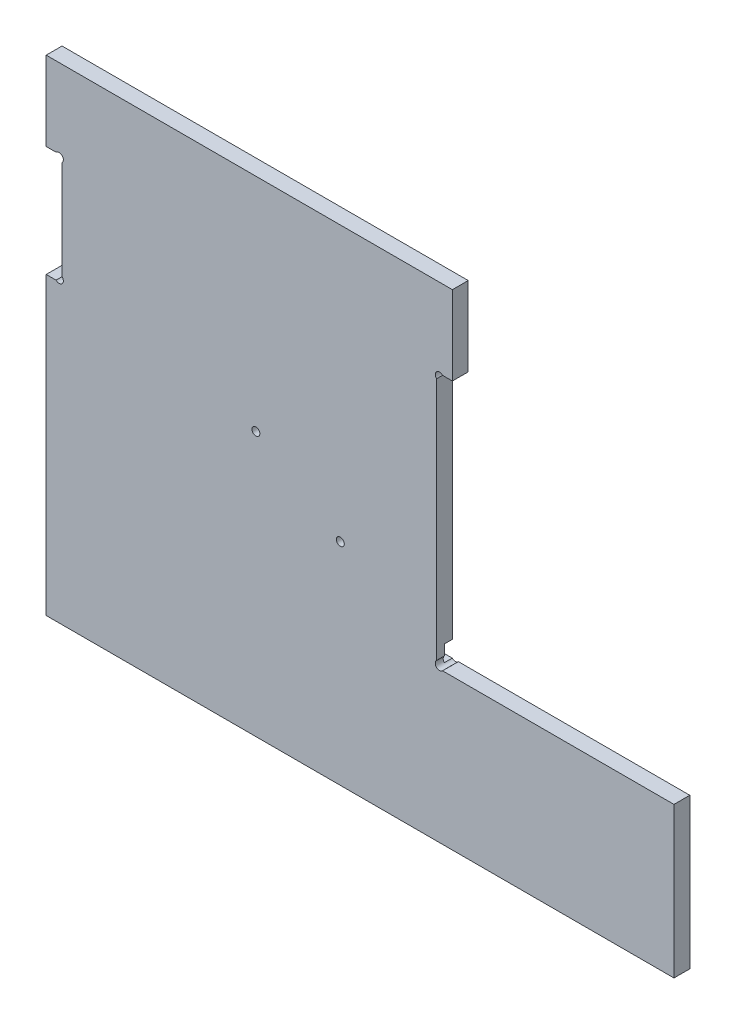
from build123d import *

# Parameters (mm, degrees)
BASE_EXTRUSION_DEPTH    = 6
ESCALIER_W              = 35
ESCALIER_H              = 6.2
ESCALIER_W_2            = 65
ESCALIER_H_2            = 6.4
ESCALIER_W_3            = 22
ENL_V_MAT_EXTRU_2_DEPTH = 3
ENL_V_START             = -6
ESQUISSE3_R             = 1.5
ENL_V_MAT_EXTRU_1_DEPTH = 3
ESQUISSE7_W             = 6
ESQUISSE7_H             = 30
EXTRUSION1_DEPTH        = 6
ESQUISSE9_W             = 6
ESQUISSE9_H             = 42
ENL_V_MAT_EXTRU_5_DEPTH = 6
ESQUISSE4_R             = 1.6
ENL_V_MAT_EXTRU_3_DEPTH = 3
ESQUISSE6_R             = 1.6
ENL_V_MAT_EXTRU_4_DEPTH = 6


with BuildPart() as part:
    # Esquisse1 → Base-Extrusion (new body)
    with BuildSketch(Plane.XY):
        Polygon((132.817421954, -51.030312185), (222.817421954, -51.030312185), (222.817421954, -108.030312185), (118.817421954, -108.030312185), (-15.182578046, -108.030312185), (-15.182578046, 75.969687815), (132.817421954, 75.969687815), align=None)
    extrude(amount=BASE_EXTRUSION_DEPTH)

    # escalier → Enl_v. mat.-Extru.2 (cut)
    with BuildSketch(Plane(origin=(0, 0, 0), x_dir=(-1, 0, 0), z_dir=(0, 0, -1))):
        with Locations((-96.317421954, -27.930312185)):
            Rectangle(ESCALIER_W, ESCALIER_H)
        with Locations((-64.317421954, -7.930312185)):
            Rectangle(ESCALIER_W, ESCALIER_H)
        with Locations((-17.317421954, 12.169687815)):
            Rectangle(ESCALIER_W_2, ESCALIER_H_2)
        with Locations((-121.817421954, -47.930312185)):
            Rectangle(ESCALIER_W_3, ESCALIER_H)
    extrude(amount=-ENL_V_MAT_EXTRU_2_DEPTH, mode=Mode.SUBTRACT)

    # Esquisse3 → Enl_v. mat.-Extru.1 (cut)
    with BuildSketch(Plane(origin=(0, 0, 0), x_dir=(-1, 0, 0), z_dir=(0, 0, -1)).offset(ENL_V_START)):
        with Locations((-96.317421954, -28.030312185)):
            Circle(ESQUISSE3_R)
        with Locations((-64.317421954, -7.830312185)):
            Circle(ESQUISSE3_R)
    extrude(amount=ENL_V_MAT_EXTRU_1_DEPTH, mode=Mode.SUBTRACT)

    # Esquisse7 → Extrusion1 (add)
    with BuildSketch(Plane(origin=(132.817421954, 0, 0), x_dir=(0, 0, -1), z_dir=(1, 0, 0))):
        with Locations((-3, 60.969687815)):
            Rectangle(ESQUISSE7_W, ESQUISSE7_H)
    extrude(amount=EXTRUSION1_DEPTH)

    # Esquisse9 → Enl_v. mat.-Extru.5 (cut)
    with BuildSketch(Plane(origin=(0, 0, 0), x_dir=(-1, 0, 0), z_dir=(0, 0, -1))):
        with Locations((12.182578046, 24.969687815)):
            Rectangle(ESQUISSE9_W, ESQUISSE9_H)
    extrude(amount=-ENL_V_MAT_EXTRU_5_DEPTH, mode=Mode.SUBTRACT)

    # Esquisse4 → Enl_v. mat.-Extru.3 (cut)
    with BuildSketch(Plane(origin=(0, 0, 0), x_dir=(-1, 0, 0), z_dir=(0, 0, -1))):
        with Locations((-112.717421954, -25.930312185)):
            Circle(ESQUISSE4_R)
        with Locations((-112.717421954, -29.930312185)):
            Circle(ESQUISSE4_R)
        with Locations((-79.917421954, -25.930312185)):
            Circle(ESQUISSE4_R)
        with Locations((-79.917421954, -29.930312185)):
            Circle(ESQUISSE4_R)
        with Locations((-47.917421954, -5.930312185)):
            Circle(ESQUISSE4_R)
        with Locations((-80.717421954, -5.930312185)):
            Circle(ESQUISSE4_R)
        with Locations((-47.917421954, -9.930312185)):
            Circle(ESQUISSE4_R)
        with Locations((-80.717421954, -9.930312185)):
            Circle(ESQUISSE4_R)
        with Locations((-48.717421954, 14.269687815)):
            Circle(ESQUISSE4_R)
        with Locations((-111.917421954, -45.930312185)):
            Circle(ESQUISSE4_R)
        with Locations((-48.717421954, 10.069687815)):
            Circle(ESQUISSE4_R)
        with Locations((-111.917421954, -49.930312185)):
            Circle(ESQUISSE4_R)
    extrude(amount=-ENL_V_MAT_EXTRU_3_DEPTH, mode=Mode.SUBTRACT)

    # Esquisse6 → Enl_v. mat.-Extru.4 (cut)
    with BuildSketch(Plane(origin=(0, 0, 0), x_dir=(-1, 0, 0), z_dir=(0, 0, -1))):
        with Locations((-133.917421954, -49.930312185)):
            Circle(ESQUISSE6_R)
        with Locations((-133.917421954, 44.869687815)):
            Circle(ESQUISSE6_R)
        with Locations((10.282578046, 44.869687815)):
            Circle(ESQUISSE6_R)
        with Locations((10.282578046, 5.069687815)):
            Circle(ESQUISSE6_R)
    extrude(amount=-ENL_V_MAT_EXTRU_4_DEPTH, mode=Mode.SUBTRACT)


solid = part.part
